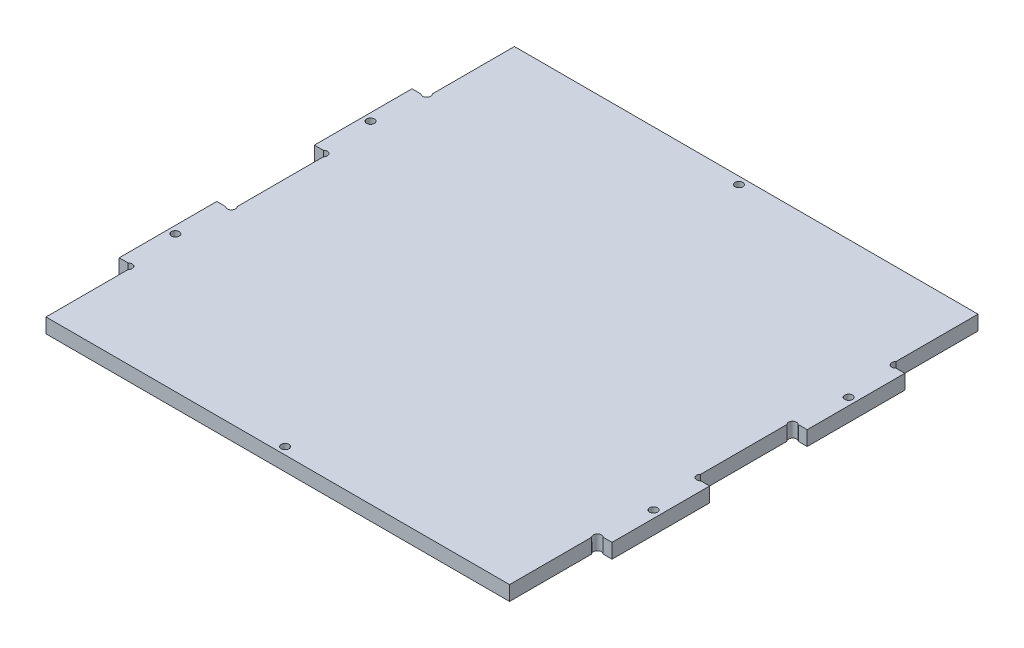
ISO-10303-21;
HEADER;
FILE_DESCRIPTION(('STEP AP214'),'2;1');
FILE_NAME('part.step','',(''),(''),'','','');
FILE_SCHEMA(('AUTOMOTIVE_DESIGN { 1 0 10303 214 1 1 1 1 }'));
ENDSEC;
DATA;
#1=APPLICATION_CONTEXT('core data for automotive mechanical design processes');
#2=APPLICATION_PROTOCOL_DEFINITION('international standard','automotive_design',2000,#1);
#3=PRODUCT_CONTEXT('',#1,'mechanical');
#4=PRODUCT('Part','Part','',(#3));
#5=PRODUCT_RELATED_PRODUCT_CATEGORY('part','',(#4));
#6=PRODUCT_DEFINITION_FORMATION('','',#4);
#7=PRODUCT_DEFINITION_CONTEXT('part definition',#1,'design');
#8=PRODUCT_DEFINITION('design','',#6,#7);
#9=PRODUCT_DEFINITION_SHAPE('','',#8);
#10=(LENGTH_UNIT() NAMED_UNIT(*) SI_UNIT(.MILLI.,.METRE.));
#11=(NAMED_UNIT(*) PLANE_ANGLE_UNIT() SI_UNIT($,.RADIAN.));
#12=(NAMED_UNIT(*) SI_UNIT($,.STERADIAN.) SOLID_ANGLE_UNIT());
#13=UNCERTAINTY_MEASURE_WITH_UNIT(LENGTH_MEASURE(1.E-05),#10,'distance_accuracy_value','');
#14=(GEOMETRIC_REPRESENTATION_CONTEXT(3) GLOBAL_UNCERTAINTY_ASSIGNED_CONTEXT((#13)) GLOBAL_UNIT_ASSIGNED_CONTEXT((#10,
#11,#12)) REPRESENTATION_CONTEXT('',''));
#15=CARTESIAN_POINT('',(0.,0.,0.));
#16=DIRECTION('',(0.,0.,1.));
#17=DIRECTION('',(1.,0.,0.));
#18=AXIS2_PLACEMENT_3D('',#15,#16,#17);
#19=CARTESIAN_POINT('',(96.1670078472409,6.,-18.8329921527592));
#20=DIRECTION('',(0.,1.,0.));
#21=DIRECTION('',(0.,0.,1.));
#22=AXIS2_PLACEMENT_3D('',#19,#20,#21);
#23=PLANE('',#22);
#24=CARTESIAN_POINT('',(0.,6.,-92.9999999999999));
#25=DIRECTION('',(0.,1.,0.));
#26=DIRECTION('',(0.,0.,1.));
#27=AXIS2_PLACEMENT_3D('',#24,#25,#26);
#28=CIRCLE('',#27,1.6);
#29=CARTESIAN_POINT('',(0.,6.,-91.3999999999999));
#30=VERTEX_POINT('',#29);
#31=EDGE_CURVE('E512',#30,#30,#28,.T.);
#32=ORIENTED_EDGE('',*,*,#31,.F.);
#33=EDGE_LOOP('',(#32));
#34=FACE_BOUND('',#33,.T.);
#35=CARTESIAN_POINT('',(-98.,6.,40.));
#36=DIRECTION('',(0.,1.,0.));
#37=DIRECTION('',(0.,0.,1.));
#38=AXIS2_PLACEMENT_3D('',#35,#36,#37);
#39=CIRCLE('',#38,1.60000000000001);
#40=CARTESIAN_POINT('',(-98.,6.,41.6));
#41=VERTEX_POINT('',#40);
#42=EDGE_CURVE('E524',#41,#41,#39,.T.);
#43=ORIENTED_EDGE('',*,*,#42,.F.);
#44=EDGE_LOOP('',(#43));
#45=FACE_BOUND('',#44,.T.);
#46=CARTESIAN_POINT('',(98.,6.,-40.));
#47=DIRECTION('',(0.,1.,0.));
#48=DIRECTION('',(0.,0.,1.));
#49=AXIS2_PLACEMENT_3D('',#46,#47,#48);
#50=CIRCLE('',#49,1.60000000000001);
#51=CARTESIAN_POINT('',(98.,6.,-38.4));
#52=VERTEX_POINT('',#51);
#53=EDGE_CURVE('E258',#52,#52,#50,.T.);
#54=ORIENTED_EDGE('',*,*,#53,.F.);
#55=EDGE_LOOP('',(#54));
#56=FACE_BOUND('',#55,.T.);
#57=CARTESIAN_POINT('',(96.1670078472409,6.,-18.8329921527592));
#58=DIRECTION('',(0.,-1.,0.));
#59=DIRECTION('',(0.,0.,1.));
#60=AXIS2_PLACEMENT_3D('',#57,#58,#59);
#61=CIRCLE('',#60,1.65039832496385);
#62=CARTESIAN_POINT('',(95.,6.,-17.6659843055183));
#63=VERTEX_POINT('',#62);
#64=CARTESIAN_POINT('',(97.3340156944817,6.,-20.));
#65=VERTEX_POINT('',#64);
#66=EDGE_CURVE('E309',#63,#65,#61,.T.);
#67=ORIENTED_EDGE('',*,*,#66,.T.);
#68=DIRECTION('',(1.,0.,0.));
#69=VECTOR('',#68,1.);
#70=CARTESIAN_POINT('',(97.3340156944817,6.,-20.));
#71=LINE('',#70,#69);
#72=CARTESIAN_POINT('',(101.,6.,-20.));
#73=VERTEX_POINT('',#72);
#74=EDGE_CURVE('E157',#65,#73,#71,.T.);
#75=ORIENTED_EDGE('',*,*,#74,.T.);
#76=DIRECTION('',(0.,0.,-1.));
#77=VECTOR('',#76,1.);
#78=CARTESIAN_POINT('',(101.,6.,-60.));
#79=LINE('',#78,#77);
#80=CARTESIAN_POINT('',(101.,6.,-60.));
#81=VERTEX_POINT('',#80);
#82=EDGE_CURVE('E384',#73,#81,#79,.T.);
#83=ORIENTED_EDGE('',*,*,#82,.T.);
#84=DIRECTION('',(-1.,0.,0.));
#85=VECTOR('',#84,1.);
#86=CARTESIAN_POINT('',(97.3340156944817,6.,-60.));
#87=LINE('',#86,#85);
#88=CARTESIAN_POINT('',(97.3340156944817,6.,-60.));
#89=VERTEX_POINT('',#88);
#90=EDGE_CURVE('E403',#81,#89,#87,.T.);
#91=ORIENTED_EDGE('',*,*,#90,.T.);
#92=CARTESIAN_POINT('',(96.1670078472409,6.,-61.1670078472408));
#93=DIRECTION('',(0.,-1.,0.));
#94=DIRECTION('',(0.,0.,-1.));
#95=AXIS2_PLACEMENT_3D('',#92,#93,#94);
#96=CIRCLE('',#95,1.65039832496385);
#97=CARTESIAN_POINT('',(95.,6.,-62.3340156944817));
#98=VERTEX_POINT('',#97);
#99=EDGE_CURVE('E400',#89,#98,#96,.T.);
#100=ORIENTED_EDGE('',*,*,#99,.T.);
#101=DIRECTION('',(0.,0.,-1.));
#102=VECTOR('',#101,1.);
#103=CARTESIAN_POINT('',(95.,6.,-62.3340156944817));
#104=LINE('',#103,#102);
#105=CARTESIAN_POINT('',(95.,6.,-96.));
#106=VERTEX_POINT('',#105);
#107=EDGE_CURVE('E402',#98,#106,#104,.T.);
#108=ORIENTED_EDGE('',*,*,#107,.T.);
#109=DIRECTION('',(-1.,0.,0.));
#110=VECTOR('',#109,1.);
#111=CARTESIAN_POINT('',(-95.0000000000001,6.,-96.));
#112=LINE('',#111,#110);
#113=CARTESIAN_POINT('',(-95.0000000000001,6.,-96.));
#114=VERTEX_POINT('',#113);
#115=EDGE_CURVE('E405',#106,#114,#112,.T.);
#116=ORIENTED_EDGE('',*,*,#115,.T.);
#117=DIRECTION('',(0.,0.,1.));
#118=VECTOR('',#117,1.);
#119=CARTESIAN_POINT('',(-95.,6.,-62.3340156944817));
#120=LINE('',#119,#118);
#121=CARTESIAN_POINT('',(-95.,6.,-62.3340156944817));
#122=VERTEX_POINT('',#121);
#123=EDGE_CURVE('E411',#114,#122,#120,.T.);
#124=ORIENTED_EDGE('',*,*,#123,.T.);
#125=CARTESIAN_POINT('',(-96.1670078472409,6.,-61.1670078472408));
#126=DIRECTION('',(0.,-1.,0.));
#127=DIRECTION('',(0.,0.,1.));
#128=AXIS2_PLACEMENT_3D('',#125,#126,#127);
#129=CIRCLE('',#128,1.65039832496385);
#130=CARTESIAN_POINT('',(-97.3340156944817,6.,-60.));
#131=VERTEX_POINT('',#130);
#132=EDGE_CURVE('E413',#122,#131,#129,.T.);
#133=ORIENTED_EDGE('',*,*,#132,.T.);
#134=DIRECTION('',(-1.,0.,0.));
#135=VECTOR('',#134,1.);
#136=CARTESIAN_POINT('',(-97.3340156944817,6.,-60.));
#137=LINE('',#136,#135);
#138=CARTESIAN_POINT('',(-101.,6.,-60.));
#139=VERTEX_POINT('',#138);
#140=EDGE_CURVE('E415',#131,#139,#137,.T.);
#141=ORIENTED_EDGE('',*,*,#140,.T.);
#142=DIRECTION('',(0.,0.,1.));
#143=VECTOR('',#142,1.);
#144=CARTESIAN_POINT('',(-101.,6.,-60.));
#145=LINE('',#144,#143);
#146=CARTESIAN_POINT('',(-101.,6.,-20.));
#147=VERTEX_POINT('',#146);
#148=EDGE_CURVE('E417',#139,#147,#145,.T.);
#149=ORIENTED_EDGE('',*,*,#148,.T.);
#150=DIRECTION('',(1.,0.,0.));
#151=VECTOR('',#150,1.);
#152=CARTESIAN_POINT('',(-97.3340156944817,6.,-19.9999999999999));
#153=LINE('',#152,#151);
#154=CARTESIAN_POINT('',(-97.3340156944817,6.,-19.9999999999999));
#155=VERTEX_POINT('',#154);
#156=EDGE_CURVE('E419',#147,#155,#153,.T.);
#157=ORIENTED_EDGE('',*,*,#156,.T.);
#158=CARTESIAN_POINT('',(-96.1670078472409,6.,-18.8329921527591));
#159=DIRECTION('',(0.,-1.,0.));
#160=DIRECTION('',(0.,0.,-1.));
#161=AXIS2_PLACEMENT_3D('',#158,#159,#160);
#162=CIRCLE('',#161,1.65039832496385);
#163=CARTESIAN_POINT('',(-95.,6.,-17.6659843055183));
#164=VERTEX_POINT('',#163);
#165=EDGE_CURVE('E421',#155,#164,#162,.T.);
#166=ORIENTED_EDGE('',*,*,#165,.T.);
#167=DIRECTION('',(0.,0.,1.));
#168=VECTOR('',#167,1.);
#169=CARTESIAN_POINT('',(-95.,6.,-17.6659843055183));
#170=LINE('',#169,#168);
#171=CARTESIAN_POINT('',(-95.,6.,17.6659843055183));
#172=VERTEX_POINT('',#171);
#173=EDGE_CURVE('E423',#164,#172,#170,.T.);
#174=ORIENTED_EDGE('',*,*,#173,.T.);
#175=CARTESIAN_POINT('',(-96.1670078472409,6.,18.8329921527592));
#176=DIRECTION('',(0.,-1.,0.));
#177=DIRECTION('',(0.,0.,1.));
#178=AXIS2_PLACEMENT_3D('',#175,#176,#177);
#179=CIRCLE('',#178,1.65039832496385);
#180=CARTESIAN_POINT('',(-97.3340156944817,6.,20.));
#181=VERTEX_POINT('',#180);
#182=EDGE_CURVE('E425',#172,#181,#179,.T.);
#183=ORIENTED_EDGE('',*,*,#182,.T.);
#184=DIRECTION('',(-1.,0.,0.));
#185=VECTOR('',#184,1.);
#186=CARTESIAN_POINT('',(-97.3340156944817,6.,20.));
#187=LINE('',#186,#185);
#188=CARTESIAN_POINT('',(-101.,6.,20.));
#189=VERTEX_POINT('',#188);
#190=EDGE_CURVE('E427',#181,#189,#187,.T.);
#191=ORIENTED_EDGE('',*,*,#190,.T.);
#192=DIRECTION('',(0.,0.,1.));
#193=VECTOR('',#192,1.);
#194=CARTESIAN_POINT('',(-101.,6.,60.));
#195=LINE('',#194,#193);
#196=CARTESIAN_POINT('',(-101.,6.,60.));
#197=VERTEX_POINT('',#196);
#198=EDGE_CURVE('E429',#189,#197,#195,.T.);
#199=ORIENTED_EDGE('',*,*,#198,.T.);
#200=DIRECTION('',(1.,0.,0.));
#201=VECTOR('',#200,1.);
#202=CARTESIAN_POINT('',(-97.3340156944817,6.,60.0000000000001));
#203=LINE('',#202,#201);
#204=CARTESIAN_POINT('',(-97.3340156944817,6.,60.0000000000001));
#205=VERTEX_POINT('',#204);
#206=EDGE_CURVE('E431',#197,#205,#203,.T.);
#207=ORIENTED_EDGE('',*,*,#206,.T.);
#208=CARTESIAN_POINT('',(-96.1670078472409,6.,61.1670078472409));
#209=DIRECTION('',(0.,-1.,0.));
#210=DIRECTION('',(0.,0.,-1.));
#211=AXIS2_PLACEMENT_3D('',#208,#209,#210);
#212=CIRCLE('',#211,1.65039832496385);
#213=CARTESIAN_POINT('',(-95.,6.,62.3340156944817));
#214=VERTEX_POINT('',#213);
#215=EDGE_CURVE('E433',#205,#214,#212,.T.);
#216=ORIENTED_EDGE('',*,*,#215,.T.);
#217=DIRECTION('',(0.,0.,1.));
#218=VECTOR('',#217,1.);
#219=CARTESIAN_POINT('',(-95.,6.,62.3340156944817));
#220=LINE('',#219,#218);
#221=CARTESIAN_POINT('',(-95.,6.,96.));
#222=VERTEX_POINT('',#221);
#223=EDGE_CURVE('E435',#214,#222,#220,.T.);
#224=ORIENTED_EDGE('',*,*,#223,.T.);
#225=DIRECTION('',(1.,0.,0.));
#226=VECTOR('',#225,1.);
#227=CARTESIAN_POINT('',(-95.,6.,96.));
#228=LINE('',#227,#226);
#229=CARTESIAN_POINT('',(95.,6.,96.));
#230=VERTEX_POINT('',#229);
#231=EDGE_CURVE('E437',#222,#230,#228,.T.);
#232=ORIENTED_EDGE('',*,*,#231,.T.);
#233=DIRECTION('',(0.,0.,-1.));
#234=VECTOR('',#233,1.);
#235=CARTESIAN_POINT('',(95.,6.,62.3340156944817));
#236=LINE('',#235,#234);
#237=CARTESIAN_POINT('',(95.,6.,62.3340156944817));
#238=VERTEX_POINT('',#237);
#239=EDGE_CURVE('E439',#230,#238,#236,.T.);
#240=ORIENTED_EDGE('',*,*,#239,.T.);
#241=CARTESIAN_POINT('',(96.1670078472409,6.,61.1670078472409));
#242=DIRECTION('',(0.,-1.,0.));
#243=DIRECTION('',(0.,0.,1.));
#244=AXIS2_PLACEMENT_3D('',#241,#242,#243);
#245=CIRCLE('',#244,1.65039832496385);
#246=CARTESIAN_POINT('',(97.3340156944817,6.,60.));
#247=VERTEX_POINT('',#246);
#248=EDGE_CURVE('E441',#238,#247,#245,.T.);
#249=ORIENTED_EDGE('',*,*,#248,.T.);
#250=DIRECTION('',(1.,0.,0.));
#251=VECTOR('',#250,1.);
#252=CARTESIAN_POINT('',(97.3340156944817,6.,60.));
#253=LINE('',#252,#251);
#254=CARTESIAN_POINT('',(101.,6.,60.));
#255=VERTEX_POINT('',#254);
#256=EDGE_CURVE('E443',#247,#255,#253,.T.);
#257=ORIENTED_EDGE('',*,*,#256,.T.);
#258=DIRECTION('',(0.,0.,-1.));
#259=VECTOR('',#258,1.);
#260=CARTESIAN_POINT('',(101.,6.,60.));
#261=LINE('',#260,#259);
#262=CARTESIAN_POINT('',(101.,6.,20.));
#263=VERTEX_POINT('',#262);
#264=EDGE_CURVE('E236',#255,#263,#261,.T.);
#265=ORIENTED_EDGE('',*,*,#264,.T.);
#266=DIRECTION('',(-1.,0.,0.));
#267=VECTOR('',#266,1.);
#268=CARTESIAN_POINT('',(97.3340156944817,6.,20.));
#269=LINE('',#268,#267);
#270=CARTESIAN_POINT('',(97.3340156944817,6.,20.));
#271=VERTEX_POINT('',#270);
#272=EDGE_CURVE('E230',#263,#271,#269,.T.);
#273=ORIENTED_EDGE('',*,*,#272,.T.);
#274=CARTESIAN_POINT('',(96.1670078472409,6.,18.8329921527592));
#275=DIRECTION('',(0.,-1.,0.));
#276=DIRECTION('',(0.,0.,-1.));
#277=AXIS2_PLACEMENT_3D('',#274,#275,#276);
#278=CIRCLE('',#277,1.65039832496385);
#279=CARTESIAN_POINT('',(95.,6.,17.6659843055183));
#280=VERTEX_POINT('',#279);
#281=EDGE_CURVE('E234',#271,#280,#278,.T.);
#282=ORIENTED_EDGE('',*,*,#281,.T.);
#283=DIRECTION('',(0.,0.,-1.));
#284=VECTOR('',#283,1.);
#285=CARTESIAN_POINT('',(95.,6.,-17.6659843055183));
#286=LINE('',#285,#284);
#287=EDGE_CURVE('E54',#280,#63,#286,.T.);
#288=ORIENTED_EDGE('',*,*,#287,.T.);
#289=EDGE_LOOP('',(#67,#75,#83,#91,#100,#108,#116,#124,#133,#141,#149,#157,#166,#174,#183,#191,
#199,#207,#216,#224,#232,#240,#249,#257,#265,#273,#282,#288));
#290=FACE_BOUND('',#289,.T.);
#291=CARTESIAN_POINT('',(98.,6.,40.));
#292=DIRECTION('',(0.,1.,0.));
#293=DIRECTION('',(0.,0.,-1.));
#294=AXIS2_PLACEMENT_3D('',#291,#292,#293);
#295=CIRCLE('',#294,1.60000000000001);
#296=CARTESIAN_POINT('',(98.,6.,38.4));
#297=VERTEX_POINT('',#296);
#298=EDGE_CURVE('E530',#297,#297,#295,.T.);
#299=ORIENTED_EDGE('',*,*,#298,.F.);
#300=EDGE_LOOP('',(#299));
#301=FACE_BOUND('',#300,.T.);
#302=CARTESIAN_POINT('',(-98.,6.,-40.));
#303=DIRECTION('',(0.,1.,0.));
#304=DIRECTION('',(0.,0.,-1.));
#305=AXIS2_PLACEMENT_3D('',#302,#303,#304);
#306=CIRCLE('',#305,1.60000000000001);
#307=CARTESIAN_POINT('',(-98.,6.,-41.6));
#308=VERTEX_POINT('',#307);
#309=EDGE_CURVE('E518',#308,#308,#306,.T.);
#310=ORIENTED_EDGE('',*,*,#309,.F.);
#311=EDGE_LOOP('',(#310));
#312=FACE_BOUND('',#311,.T.);
#313=CARTESIAN_POINT('',(0.,6.,92.9999999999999));
#314=DIRECTION('',(0.,1.,0.));
#315=DIRECTION('',(0.,0.,-1.));
#316=AXIS2_PLACEMENT_3D('',#313,#314,#315);
#317=CIRCLE('',#316,1.6);
#318=CARTESIAN_POINT('',(0.,6.,91.3999999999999));
#319=VERTEX_POINT('',#318);
#320=EDGE_CURVE('E503',#319,#319,#317,.T.);
#321=ORIENTED_EDGE('',*,*,#320,.F.);
#322=EDGE_LOOP('',(#321));
#323=FACE_BOUND('',#322,.T.);
#324=ADVANCED_FACE('F37',(#34,#45,#56,#290,#301,#312,#323),#23,.T.);
#325=CARTESIAN_POINT('',(96.1670078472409,0.,-18.8329921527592));
#326=DIRECTION('',(0.,1.,0.));
#327=DIRECTION('',(0.,0.,1.));
#328=AXIS2_PLACEMENT_3D('',#325,#326,#327);
#329=PLANE('',#328);
#330=CARTESIAN_POINT('',(0.,0.,-92.9999999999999));
#331=DIRECTION('',(0.,1.,0.));
#332=DIRECTION('',(0.,0.,1.));
#333=AXIS2_PLACEMENT_3D('',#330,#331,#332);
#334=CIRCLE('',#333,1.6);
#335=CARTESIAN_POINT('',(0.,0.,-91.3999999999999));
#336=VERTEX_POINT('',#335);
#337=EDGE_CURVE('E509',#336,#336,#334,.T.);
#338=ORIENTED_EDGE('',*,*,#337,.T.);
#339=EDGE_LOOP('',(#338));
#340=FACE_BOUND('',#339,.T.);
#341=CARTESIAN_POINT('',(-98.,0.,40.));
#342=DIRECTION('',(0.,1.,0.));
#343=DIRECTION('',(0.,0.,1.));
#344=AXIS2_PLACEMENT_3D('',#341,#342,#343);
#345=CIRCLE('',#344,1.60000000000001);
#346=CARTESIAN_POINT('',(-98.,0.,41.6));
#347=VERTEX_POINT('',#346);
#348=EDGE_CURVE('E521',#347,#347,#345,.T.);
#349=ORIENTED_EDGE('',*,*,#348,.T.);
#350=EDGE_LOOP('',(#349));
#351=FACE_BOUND('',#350,.T.);
#352=CARTESIAN_POINT('',(98.,0.,-40.));
#353=DIRECTION('',(0.,1.,0.));
#354=DIRECTION('',(0.,0.,1.));
#355=AXIS2_PLACEMENT_3D('',#352,#353,#354);
#356=CIRCLE('',#355,1.60000000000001);
#357=CARTESIAN_POINT('',(98.,0.,-38.4));
#358=VERTEX_POINT('',#357);
#359=EDGE_CURVE('E533',#358,#358,#356,.T.);
#360=ORIENTED_EDGE('',*,*,#359,.T.);
#361=EDGE_LOOP('',(#360));
#362=FACE_BOUND('',#361,.T.);
#363=CARTESIAN_POINT('',(96.1670078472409,0.,-18.8329921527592));
#364=DIRECTION('',(0.,-1.,0.));
#365=DIRECTION('',(0.,0.,1.));
#366=AXIS2_PLACEMENT_3D('',#363,#364,#365);
#367=CIRCLE('',#366,1.65039832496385);
#368=CARTESIAN_POINT('',(95.,0.,-17.6659843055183));
#369=VERTEX_POINT('',#368);
#370=CARTESIAN_POINT('',(97.3340156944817,0.,-20.));
#371=VERTEX_POINT('',#370);
#372=EDGE_CURVE('E254',#369,#371,#367,.T.);
#373=ORIENTED_EDGE('',*,*,#372,.F.);
#374=DIRECTION('',(0.,0.,-1.));
#375=VECTOR('',#374,1.);
#376=CARTESIAN_POINT('',(95.,0.,-17.6659843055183));
#377=LINE('',#376,#375);
#378=CARTESIAN_POINT('',(95.,0.,17.6659843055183));
#379=VERTEX_POINT('',#378);
#380=EDGE_CURVE('E149',#379,#369,#377,.T.);
#381=ORIENTED_EDGE('',*,*,#380,.F.);
#382=CARTESIAN_POINT('',(96.1670078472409,0.,18.8329921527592));
#383=DIRECTION('',(0.,-1.,0.));
#384=DIRECTION('',(0.,0.,-1.));
#385=AXIS2_PLACEMENT_3D('',#382,#383,#384);
#386=CIRCLE('',#385,1.65039832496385);
#387=CARTESIAN_POINT('',(97.3340156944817,0.,20.));
#388=VERTEX_POINT('',#387);
#389=EDGE_CURVE('E143',#388,#379,#386,.T.);
#390=ORIENTED_EDGE('',*,*,#389,.F.);
#391=DIRECTION('',(-1.,0.,0.));
#392=VECTOR('',#391,1.);
#393=CARTESIAN_POINT('',(97.3340156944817,0.,20.));
#394=LINE('',#393,#392);
#395=CARTESIAN_POINT('',(101.,0.,20.));
#396=VERTEX_POINT('',#395);
#397=EDGE_CURVE('E244',#396,#388,#394,.T.);
#398=ORIENTED_EDGE('',*,*,#397,.F.);
#399=DIRECTION('',(0.,0.,-1.));
#400=VECTOR('',#399,1.);
#401=CARTESIAN_POINT('',(101.,0.,60.));
#402=LINE('',#401,#400);
#403=CARTESIAN_POINT('',(101.,0.,60.));
#404=VERTEX_POINT('',#403);
#405=EDGE_CURVE('E304',#404,#396,#402,.T.);
#406=ORIENTED_EDGE('',*,*,#405,.F.);
#407=DIRECTION('',(1.,0.,0.));
#408=VECTOR('',#407,1.);
#409=CARTESIAN_POINT('',(97.3340156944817,0.,60.));
#410=LINE('',#409,#408);
#411=CARTESIAN_POINT('',(97.3340156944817,0.,60.));
#412=VERTEX_POINT('',#411);
#413=EDGE_CURVE('E302',#412,#404,#410,.T.);
#414=ORIENTED_EDGE('',*,*,#413,.F.);
#415=CARTESIAN_POINT('',(96.1670078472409,0.,61.1670078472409));
#416=DIRECTION('',(0.,-1.,0.));
#417=DIRECTION('',(0.,0.,1.));
#418=AXIS2_PLACEMENT_3D('',#415,#416,#417);
#419=CIRCLE('',#418,1.65039832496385);
#420=CARTESIAN_POINT('',(95.,0.,62.3340156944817));
#421=VERTEX_POINT('',#420);
#422=EDGE_CURVE('E300',#421,#412,#419,.T.);
#423=ORIENTED_EDGE('',*,*,#422,.F.);
#424=DIRECTION('',(0.,0.,-1.));
#425=VECTOR('',#424,1.);
#426=CARTESIAN_POINT('',(95.,0.,62.3340156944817));
#427=LINE('',#426,#425);
#428=CARTESIAN_POINT('',(95.,0.,96.));
#429=VERTEX_POINT('',#428);
#430=EDGE_CURVE('E298',#429,#421,#427,.T.);
#431=ORIENTED_EDGE('',*,*,#430,.F.);
#432=DIRECTION('',(1.,0.,0.));
#433=VECTOR('',#432,1.);
#434=CARTESIAN_POINT('',(-95.,0.,96.));
#435=LINE('',#434,#433);
#436=CARTESIAN_POINT('',(-95.,0.,96.));
#437=VERTEX_POINT('',#436);
#438=EDGE_CURVE('E296',#437,#429,#435,.T.);
#439=ORIENTED_EDGE('',*,*,#438,.F.);
#440=DIRECTION('',(0.,0.,1.));
#441=VECTOR('',#440,1.);
#442=CARTESIAN_POINT('',(-95.,0.,62.3340156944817));
#443=LINE('',#442,#441);
#444=CARTESIAN_POINT('',(-95.,0.,62.3340156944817));
#445=VERTEX_POINT('',#444);
#446=EDGE_CURVE('E294',#445,#437,#443,.T.);
#447=ORIENTED_EDGE('',*,*,#446,.F.);
#448=CARTESIAN_POINT('',(-96.1670078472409,0.,61.1670078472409));
#449=DIRECTION('',(0.,-1.,0.));
#450=DIRECTION('',(0.,0.,-1.));
#451=AXIS2_PLACEMENT_3D('',#448,#449,#450);
#452=CIRCLE('',#451,1.65039832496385);
#453=CARTESIAN_POINT('',(-97.3340156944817,0.,60.0000000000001));
#454=VERTEX_POINT('',#453);
#455=EDGE_CURVE('E292',#454,#445,#452,.T.);
#456=ORIENTED_EDGE('',*,*,#455,.F.);
#457=DIRECTION('',(1.,0.,0.));
#458=VECTOR('',#457,1.);
#459=CARTESIAN_POINT('',(-97.3340156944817,0.,60.0000000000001));
#460=LINE('',#459,#458);
#461=CARTESIAN_POINT('',(-101.,0.,60.));
#462=VERTEX_POINT('',#461);
#463=EDGE_CURVE('E290',#462,#454,#460,.T.);
#464=ORIENTED_EDGE('',*,*,#463,.F.);
#465=DIRECTION('',(0.,0.,1.));
#466=VECTOR('',#465,1.);
#467=CARTESIAN_POINT('',(-101.,0.,60.));
#468=LINE('',#467,#466);
#469=CARTESIAN_POINT('',(-101.,0.,20.));
#470=VERTEX_POINT('',#469);
#471=EDGE_CURVE('E288',#470,#462,#468,.T.);
#472=ORIENTED_EDGE('',*,*,#471,.F.);
#473=DIRECTION('',(-1.,0.,0.));
#474=VECTOR('',#473,1.);
#475=CARTESIAN_POINT('',(-97.3340156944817,0.,20.));
#476=LINE('',#475,#474);
#477=CARTESIAN_POINT('',(-97.3340156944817,0.,20.));
#478=VERTEX_POINT('',#477);
#479=EDGE_CURVE('E286',#478,#470,#476,.T.);
#480=ORIENTED_EDGE('',*,*,#479,.F.);
#481=CARTESIAN_POINT('',(-96.1670078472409,0.,18.8329921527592));
#482=DIRECTION('',(0.,-1.,0.));
#483=DIRECTION('',(0.,0.,1.));
#484=AXIS2_PLACEMENT_3D('',#481,#482,#483);
#485=CIRCLE('',#484,1.65039832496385);
#486=CARTESIAN_POINT('',(-95.,0.,17.6659843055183));
#487=VERTEX_POINT('',#486);
#488=EDGE_CURVE('E284',#487,#478,#485,.T.);
#489=ORIENTED_EDGE('',*,*,#488,.F.);
#490=DIRECTION('',(0.,0.,1.));
#491=VECTOR('',#490,1.);
#492=CARTESIAN_POINT('',(-95.,0.,-17.6659843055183));
#493=LINE('',#492,#491);
#494=CARTESIAN_POINT('',(-95.,0.,-17.6659843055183));
#495=VERTEX_POINT('',#494);
#496=EDGE_CURVE('E282',#495,#487,#493,.T.);
#497=ORIENTED_EDGE('',*,*,#496,.F.);
#498=CARTESIAN_POINT('',(-96.1670078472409,0.,-18.8329921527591));
#499=DIRECTION('',(0.,-1.,0.));
#500=DIRECTION('',(0.,0.,-1.));
#501=AXIS2_PLACEMENT_3D('',#498,#499,#500);
#502=CIRCLE('',#501,1.65039832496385);
#503=CARTESIAN_POINT('',(-97.3340156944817,0.,-19.9999999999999));
#504=VERTEX_POINT('',#503);
#505=EDGE_CURVE('E280',#504,#495,#502,.T.);
#506=ORIENTED_EDGE('',*,*,#505,.F.);
#507=DIRECTION('',(1.,0.,0.));
#508=VECTOR('',#507,1.);
#509=CARTESIAN_POINT('',(-97.3340156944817,0.,-19.9999999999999));
#510=LINE('',#509,#508);
#511=CARTESIAN_POINT('',(-101.,0.,-20.));
#512=VERTEX_POINT('',#511);
#513=EDGE_CURVE('E278',#512,#504,#510,.T.);
#514=ORIENTED_EDGE('',*,*,#513,.F.);
#515=DIRECTION('',(0.,0.,1.));
#516=VECTOR('',#515,1.);
#517=CARTESIAN_POINT('',(-101.,0.,-60.));
#518=LINE('',#517,#516);
#519=CARTESIAN_POINT('',(-101.,0.,-60.));
#520=VERTEX_POINT('',#519);
#521=EDGE_CURVE('E276',#520,#512,#518,.T.);
#522=ORIENTED_EDGE('',*,*,#521,.F.);
#523=DIRECTION('',(-1.,0.,0.));
#524=VECTOR('',#523,1.);
#525=CARTESIAN_POINT('',(-97.3340156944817,0.,-60.));
#526=LINE('',#525,#524);
#527=CARTESIAN_POINT('',(-97.3340156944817,0.,-60.));
#528=VERTEX_POINT('',#527);
#529=EDGE_CURVE('E274',#528,#520,#526,.T.);
#530=ORIENTED_EDGE('',*,*,#529,.F.);
#531=CARTESIAN_POINT('',(-96.1670078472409,0.,-61.1670078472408));
#532=DIRECTION('',(0.,-1.,0.));
#533=DIRECTION('',(0.,0.,1.));
#534=AXIS2_PLACEMENT_3D('',#531,#532,#533);
#535=CIRCLE('',#534,1.65039832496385);
#536=CARTESIAN_POINT('',(-95.,0.,-62.3340156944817));
#537=VERTEX_POINT('',#536);
#538=EDGE_CURVE('E272',#537,#528,#535,.T.);
#539=ORIENTED_EDGE('',*,*,#538,.F.);
#540=DIRECTION('',(0.,0.,1.));
#541=VECTOR('',#540,1.);
#542=CARTESIAN_POINT('',(-95.,0.,-62.3340156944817));
#543=LINE('',#542,#541);
#544=CARTESIAN_POINT('',(-95.0000000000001,0.,-96.));
#545=VERTEX_POINT('',#544);
#546=EDGE_CURVE('E270',#545,#537,#543,.T.);
#547=ORIENTED_EDGE('',*,*,#546,.F.);
#548=DIRECTION('',(-1.,0.,0.));
#549=VECTOR('',#548,1.);
#550=CARTESIAN_POINT('',(-95.0000000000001,0.,-96.));
#551=LINE('',#550,#549);
#552=CARTESIAN_POINT('',(95.,0.,-96.));
#553=VERTEX_POINT('',#552);
#554=EDGE_CURVE('E268',#553,#545,#551,.T.);
#555=ORIENTED_EDGE('',*,*,#554,.F.);
#556=DIRECTION('',(0.,0.,-1.));
#557=VECTOR('',#556,1.);
#558=CARTESIAN_POINT('',(95.,0.,-62.3340156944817));
#559=LINE('',#558,#557);
#560=CARTESIAN_POINT('',(95.,0.,-62.3340156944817));
#561=VERTEX_POINT('',#560);
#562=EDGE_CURVE('E266',#561,#553,#559,.T.);
#563=ORIENTED_EDGE('',*,*,#562,.F.);
#564=CARTESIAN_POINT('',(96.1670078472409,0.,-61.1670078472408));
#565=DIRECTION('',(0.,-1.,0.));
#566=DIRECTION('',(0.,0.,-1.));
#567=AXIS2_PLACEMENT_3D('',#564,#565,#566);
#568=CIRCLE('',#567,1.65039832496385);
#569=CARTESIAN_POINT('',(97.3340156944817,0.,-60.));
#570=VERTEX_POINT('',#569);
#571=EDGE_CURVE('E264',#570,#561,#568,.T.);
#572=ORIENTED_EDGE('',*,*,#571,.F.);
#573=DIRECTION('',(-1.,0.,0.));
#574=VECTOR('',#573,1.);
#575=CARTESIAN_POINT('',(97.3340156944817,0.,-60.));
#576=LINE('',#575,#574);
#577=CARTESIAN_POINT('',(101.,0.,-60.));
#578=VERTEX_POINT('',#577);
#579=EDGE_CURVE('E262',#578,#570,#576,.T.);
#580=ORIENTED_EDGE('',*,*,#579,.F.);
#581=DIRECTION('',(0.,0.,-1.));
#582=VECTOR('',#581,1.);
#583=CARTESIAN_POINT('',(101.,0.,-60.));
#584=LINE('',#583,#582);
#585=CARTESIAN_POINT('',(101.,0.,-20.));
#586=VERTEX_POINT('',#585);
#587=EDGE_CURVE('E260',#586,#578,#584,.T.);
#588=ORIENTED_EDGE('',*,*,#587,.F.);
#589=DIRECTION('',(1.,0.,0.));
#590=VECTOR('',#589,1.);
#591=CARTESIAN_POINT('',(97.3340156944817,0.,-20.));
#592=LINE('',#591,#590);
#593=EDGE_CURVE('E257',#371,#586,#592,.T.);
#594=ORIENTED_EDGE('',*,*,#593,.F.);
#595=EDGE_LOOP('',(#373,#381,#390,#398,#406,#414,#423,#431,#439,#447,#456,#464,#472,#480,#489,
#497,#506,#514,#522,#530,#539,#547,#555,#563,#572,#580,#588,#594));
#596=FACE_BOUND('',#595,.T.);
#597=CARTESIAN_POINT('',(98.,0.,40.));
#598=DIRECTION('',(0.,1.,0.));
#599=DIRECTION('',(0.,0.,-1.));
#600=AXIS2_PLACEMENT_3D('',#597,#598,#599);
#601=CIRCLE('',#600,1.60000000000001);
#602=CARTESIAN_POINT('',(98.,0.,38.4));
#603=VERTEX_POINT('',#602);
#604=EDGE_CURVE('E527',#603,#603,#601,.T.);
#605=ORIENTED_EDGE('',*,*,#604,.T.);
#606=EDGE_LOOP('',(#605));
#607=FACE_BOUND('',#606,.T.);
#608=CARTESIAN_POINT('',(-98.,0.,-40.));
#609=DIRECTION('',(0.,1.,0.));
#610=DIRECTION('',(0.,0.,-1.));
#611=AXIS2_PLACEMENT_3D('',#608,#609,#610);
#612=CIRCLE('',#611,1.60000000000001);
#613=CARTESIAN_POINT('',(-98.,0.,-41.6));
#614=VERTEX_POINT('',#613);
#615=EDGE_CURVE('E515',#614,#614,#612,.T.);
#616=ORIENTED_EDGE('',*,*,#615,.T.);
#617=EDGE_LOOP('',(#616));
#618=FACE_BOUND('',#617,.T.);
#619=CARTESIAN_POINT('',(0.,0.,92.9999999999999));
#620=DIRECTION('',(0.,1.,0.));
#621=DIRECTION('',(0.,0.,-1.));
#622=AXIS2_PLACEMENT_3D('',#619,#620,#621);
#623=CIRCLE('',#622,1.6);
#624=CARTESIAN_POINT('',(0.,0.,91.3999999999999));
#625=VERTEX_POINT('',#624);
#626=EDGE_CURVE('E506',#625,#625,#623,.T.);
#627=ORIENTED_EDGE('',*,*,#626,.T.);
#628=EDGE_LOOP('',(#627));
#629=FACE_BOUND('',#628,.T.);
#630=ADVANCED_FACE('F388',(#340,#351,#362,#596,#607,#618,#629),#329,.F.);
#631=CARTESIAN_POINT('',(96.1670078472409,6.,-18.8329921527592));
#632=DIRECTION('',(0.,-1.,0.));
#633=DIRECTION('',(0.,0.,-1.));
#634=AXIS2_PLACEMENT_3D('',#631,#632,#633);
#635=CYLINDRICAL_SURFACE('',#634,1.65039832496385);
#636=ORIENTED_EDGE('',*,*,#372,.T.);
#637=DIRECTION('',(0.,-1.,0.));
#638=VECTOR('',#637,1.);
#639=CARTESIAN_POINT('',(97.3340156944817,6.,-20.));
#640=LINE('',#639,#638);
#641=EDGE_CURVE('E11',#65,#371,#640,.T.);
#642=ORIENTED_EDGE('',*,*,#641,.F.);
#643=ORIENTED_EDGE('',*,*,#66,.F.);
#644=DIRECTION('',(0.,-1.,0.));
#645=VECTOR('',#644,1.);
#646=CARTESIAN_POINT('',(95.,6.,-17.6659843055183));
#647=LINE('',#646,#645);
#648=EDGE_CURVE('E250',#63,#369,#647,.T.);
#649=ORIENTED_EDGE('',*,*,#648,.T.);
#650=EDGE_LOOP('',(#636,#642,#643,#649));
#651=FACE_BOUND('',#650,.T.);
#652=ADVANCED_FACE('F39',(#651),#635,.F.);
#653=CARTESIAN_POINT('',(97.3340156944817,6.,-20.));
#654=DIRECTION('',(0.,0.,-1.));
#655=DIRECTION('',(-1.,0.,0.));
#656=AXIS2_PLACEMENT_3D('',#653,#654,#655);
#657=PLANE('',#656);
#658=ORIENTED_EDGE('',*,*,#593,.T.);
#659=DIRECTION('',(0.,-1.,0.));
#660=VECTOR('',#659,1.);
#661=CARTESIAN_POINT('',(101.,6.,-20.));
#662=LINE('',#661,#660);
#663=EDGE_CURVE('E46',#73,#586,#662,.T.);
#664=ORIENTED_EDGE('',*,*,#663,.F.);
#665=ORIENTED_EDGE('',*,*,#74,.F.);
#666=ORIENTED_EDGE('',*,*,#641,.T.);
#667=EDGE_LOOP('',(#658,#664,#665,#666));
#668=FACE_BOUND('',#667,.T.);
#669=ADVANCED_FACE('F820',(#668),#657,.F.);
#670=CARTESIAN_POINT('',(101.,6.,-60.));
#671=DIRECTION('',(-1.,0.,0.));
#672=DIRECTION('',(0.,0.,1.));
#673=AXIS2_PLACEMENT_3D('',#670,#671,#672);
#674=PLANE('',#673);
#675=ORIENTED_EDGE('',*,*,#587,.T.);
#676=DIRECTION('',(0.,-1.,0.));
#677=VECTOR('',#676,1.);
#678=CARTESIAN_POINT('',(101.,6.,-60.));
#679=LINE('',#678,#677);
#680=EDGE_CURVE('E376',#81,#578,#679,.T.);
#681=ORIENTED_EDGE('',*,*,#680,.F.);
#682=ORIENTED_EDGE('',*,*,#82,.F.);
#683=ORIENTED_EDGE('',*,*,#663,.T.);
#684=EDGE_LOOP('',(#675,#681,#682,#683));
#685=FACE_BOUND('',#684,.T.);
#686=ADVANCED_FACE('F382',(#685),#674,.F.);
#687=CARTESIAN_POINT('',(97.3340156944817,6.,-60.));
#688=DIRECTION('',(0.,0.,1.));
#689=DIRECTION('',(1.,0.,0.));
#690=AXIS2_PLACEMENT_3D('',#687,#688,#689);
#691=PLANE('',#690);
#692=ORIENTED_EDGE('',*,*,#579,.T.);
#693=DIRECTION('',(0.,-1.,0.));
#694=VECTOR('',#693,1.);
#695=CARTESIAN_POINT('',(97.3340156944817,6.,-60.));
#696=LINE('',#695,#694);
#697=EDGE_CURVE('E373',#89,#570,#696,.T.);
#698=ORIENTED_EDGE('',*,*,#697,.F.);
#699=ORIENTED_EDGE('',*,*,#90,.F.);
#700=ORIENTED_EDGE('',*,*,#680,.T.);
#701=EDGE_LOOP('',(#692,#698,#699,#700));
#702=FACE_BOUND('',#701,.T.);
#703=ADVANCED_FACE('F394',(#702),#691,.F.);
#704=CARTESIAN_POINT('',(96.1670078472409,6.,-61.1670078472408));
#705=DIRECTION('',(0.,-1.,0.));
#706=DIRECTION('',(0.,0.,-1.));
#707=AXIS2_PLACEMENT_3D('',#704,#705,#706);
#708=CYLINDRICAL_SURFACE('',#707,1.65039832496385);
#709=ORIENTED_EDGE('',*,*,#571,.T.);
#710=DIRECTION('',(0.,-1.,0.));
#711=VECTOR('',#710,1.);
#712=CARTESIAN_POINT('',(95.,6.,-62.3340156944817));
#713=LINE('',#712,#711);
#714=EDGE_CURVE('E370',#98,#561,#713,.T.);
#715=ORIENTED_EDGE('',*,*,#714,.F.);
#716=ORIENTED_EDGE('',*,*,#99,.F.);
#717=ORIENTED_EDGE('',*,*,#697,.T.);
#718=EDGE_LOOP('',(#709,#715,#716,#717));
#719=FACE_BOUND('',#718,.T.);
#720=ADVANCED_FACE('F398',(#719),#708,.F.);
#721=CARTESIAN_POINT('',(95.,6.,-62.3340156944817));
#722=DIRECTION('',(-1.,0.,0.));
#723=DIRECTION('',(0.,0.,1.));
#724=AXIS2_PLACEMENT_3D('',#721,#722,#723);
#725=PLANE('',#724);
#726=ORIENTED_EDGE('',*,*,#562,.T.);
#727=DIRECTION('',(0.,-1.,0.));
#728=VECTOR('',#727,1.);
#729=CARTESIAN_POINT('',(95.,6.,-96.));
#730=LINE('',#729,#728);
#731=EDGE_CURVE('E367',#106,#553,#730,.T.);
#732=ORIENTED_EDGE('',*,*,#731,.F.);
#733=ORIENTED_EDGE('',*,*,#107,.F.);
#734=ORIENTED_EDGE('',*,*,#714,.T.);
#735=EDGE_LOOP('',(#726,#732,#733,#734));
#736=FACE_BOUND('',#735,.T.);
#737=ADVANCED_FACE('F785',(#736),#725,.F.);
#738=CARTESIAN_POINT('',(-95.0000000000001,6.,-96.));
#739=DIRECTION('',(0.,0.,1.));
#740=DIRECTION('',(1.,0.,0.));
#741=AXIS2_PLACEMENT_3D('',#738,#739,#740);
#742=PLANE('',#741);
#743=ORIENTED_EDGE('',*,*,#554,.T.);
#744=DIRECTION('',(0.,-1.,0.));
#745=VECTOR('',#744,1.);
#746=CARTESIAN_POINT('',(-95.0000000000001,6.,-96.));
#747=LINE('',#746,#745);
#748=EDGE_CURVE('E364',#114,#545,#747,.T.);
#749=ORIENTED_EDGE('',*,*,#748,.F.);
#750=ORIENTED_EDGE('',*,*,#115,.F.);
#751=ORIENTED_EDGE('',*,*,#731,.T.);
#752=EDGE_LOOP('',(#743,#749,#750,#751));
#753=FACE_BOUND('',#752,.T.);
#754=ADVANCED_FACE('F775',(#753),#742,.F.);
#755=CARTESIAN_POINT('',(-95.,6.,-62.3340156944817));
#756=DIRECTION('',(1.,0.,0.));
#757=DIRECTION('',(0.,0.,-1.));
#758=AXIS2_PLACEMENT_3D('',#755,#756,#757);
#759=PLANE('',#758);
#760=ORIENTED_EDGE('',*,*,#546,.T.);
#761=DIRECTION('',(0.,-1.,0.));
#762=VECTOR('',#761,1.);
#763=CARTESIAN_POINT('',(-95.,6.,-62.3340156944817));
#764=LINE('',#763,#762);
#765=EDGE_CURVE('E361',#122,#537,#764,.T.);
#766=ORIENTED_EDGE('',*,*,#765,.F.);
#767=ORIENTED_EDGE('',*,*,#123,.F.);
#768=ORIENTED_EDGE('',*,*,#748,.T.);
#769=EDGE_LOOP('',(#760,#766,#767,#768));
#770=FACE_BOUND('',#769,.T.);
#771=ADVANCED_FACE('F765',(#770),#759,.F.);
#772=CARTESIAN_POINT('',(-96.1670078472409,6.,-61.1670078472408));
#773=DIRECTION('',(0.,-1.,0.));
#774=DIRECTION('',(0.,0.,-1.));
#775=AXIS2_PLACEMENT_3D('',#772,#773,#774);
#776=CYLINDRICAL_SURFACE('',#775,1.65039832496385);
#777=ORIENTED_EDGE('',*,*,#538,.T.);
#778=DIRECTION('',(0.,-1.,0.));
#779=VECTOR('',#778,1.);
#780=CARTESIAN_POINT('',(-97.3340156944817,6.,-60.));
#781=LINE('',#780,#779);
#782=EDGE_CURVE('E358',#131,#528,#781,.T.);
#783=ORIENTED_EDGE('',*,*,#782,.F.);
#784=ORIENTED_EDGE('',*,*,#132,.F.);
#785=ORIENTED_EDGE('',*,*,#765,.T.);
#786=EDGE_LOOP('',(#777,#783,#784,#785));
#787=FACE_BOUND('',#786,.T.);
#788=ADVANCED_FACE('F755',(#787),#776,.F.);
#789=CARTESIAN_POINT('',(-97.3340156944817,6.,-60.));
#790=DIRECTION('',(0.,0.,1.));
#791=DIRECTION('',(1.,0.,0.));
#792=AXIS2_PLACEMENT_3D('',#789,#790,#791);
#793=PLANE('',#792);
#794=ORIENTED_EDGE('',*,*,#529,.T.);
#795=DIRECTION('',(0.,-1.,0.));
#796=VECTOR('',#795,1.);
#797=CARTESIAN_POINT('',(-101.,6.,-60.));
#798=LINE('',#797,#796);
#799=EDGE_CURVE('E355',#139,#520,#798,.T.);
#800=ORIENTED_EDGE('',*,*,#799,.F.);
#801=ORIENTED_EDGE('',*,*,#140,.F.);
#802=ORIENTED_EDGE('',*,*,#782,.T.);
#803=EDGE_LOOP('',(#794,#800,#801,#802));
#804=FACE_BOUND('',#803,.T.);
#805=ADVANCED_FACE('F745',(#804),#793,.F.);
#806=CARTESIAN_POINT('',(-101.,6.,-60.));
#807=DIRECTION('',(1.,0.,0.));
#808=DIRECTION('',(0.,0.,-1.));
#809=AXIS2_PLACEMENT_3D('',#806,#807,#808);
#810=PLANE('',#809);
#811=ORIENTED_EDGE('',*,*,#521,.T.);
#812=DIRECTION('',(0.,-1.,0.));
#813=VECTOR('',#812,1.);
#814=CARTESIAN_POINT('',(-101.,6.,-20.));
#815=LINE('',#814,#813);
#816=EDGE_CURVE('E352',#147,#512,#815,.T.);
#817=ORIENTED_EDGE('',*,*,#816,.F.);
#818=ORIENTED_EDGE('',*,*,#148,.F.);
#819=ORIENTED_EDGE('',*,*,#799,.T.);
#820=EDGE_LOOP('',(#811,#817,#818,#819));
#821=FACE_BOUND('',#820,.T.);
#822=ADVANCED_FACE('F735',(#821),#810,.F.);
#823=CARTESIAN_POINT('',(-97.3340156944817,6.,-19.9999999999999));
#824=DIRECTION('',(0.,0.,-1.));
#825=DIRECTION('',(-1.,0.,0.));
#826=AXIS2_PLACEMENT_3D('',#823,#824,#825);
#827=PLANE('',#826);
#828=ORIENTED_EDGE('',*,*,#513,.T.);
#829=DIRECTION('',(0.,-1.,0.));
#830=VECTOR('',#829,1.);
#831=CARTESIAN_POINT('',(-97.3340156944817,6.,-19.9999999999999));
#832=LINE('',#831,#830);
#833=EDGE_CURVE('E349',#155,#504,#832,.T.);
#834=ORIENTED_EDGE('',*,*,#833,.F.);
#835=ORIENTED_EDGE('',*,*,#156,.F.);
#836=ORIENTED_EDGE('',*,*,#816,.T.);
#837=EDGE_LOOP('',(#828,#834,#835,#836));
#838=FACE_BOUND('',#837,.T.);
#839=ADVANCED_FACE('F725',(#838),#827,.F.);
#840=CARTESIAN_POINT('',(-96.1670078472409,6.,-18.8329921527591));
#841=DIRECTION('',(0.,-1.,0.));
#842=DIRECTION('',(0.,0.,-1.));
#843=AXIS2_PLACEMENT_3D('',#840,#841,#842);
#844=CYLINDRICAL_SURFACE('',#843,1.65039832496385);
#845=ORIENTED_EDGE('',*,*,#505,.T.);
#846=DIRECTION('',(0.,-1.,0.));
#847=VECTOR('',#846,1.);
#848=CARTESIAN_POINT('',(-95.,6.,-17.6659843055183));
#849=LINE('',#848,#847);
#850=EDGE_CURVE('E346',#164,#495,#849,.T.);
#851=ORIENTED_EDGE('',*,*,#850,.F.);
#852=ORIENTED_EDGE('',*,*,#165,.F.);
#853=ORIENTED_EDGE('',*,*,#833,.T.);
#854=EDGE_LOOP('',(#845,#851,#852,#853));
#855=FACE_BOUND('',#854,.T.);
#856=ADVANCED_FACE('F715',(#855),#844,.F.);
#857=CARTESIAN_POINT('',(-95.,6.,-17.6659843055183));
#858=DIRECTION('',(1.,0.,0.));
#859=DIRECTION('',(0.,0.,-1.));
#860=AXIS2_PLACEMENT_3D('',#857,#858,#859);
#861=PLANE('',#860);
#862=ORIENTED_EDGE('',*,*,#496,.T.);
#863=DIRECTION('',(0.,-1.,0.));
#864=VECTOR('',#863,1.);
#865=CARTESIAN_POINT('',(-95.,6.,17.6659843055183));
#866=LINE('',#865,#864);
#867=EDGE_CURVE('E343',#172,#487,#866,.T.);
#868=ORIENTED_EDGE('',*,*,#867,.F.);
#869=ORIENTED_EDGE('',*,*,#173,.F.);
#870=ORIENTED_EDGE('',*,*,#850,.T.);
#871=EDGE_LOOP('',(#862,#868,#869,#870));
#872=FACE_BOUND('',#871,.T.);
#873=ADVANCED_FACE('F705',(#872),#861,.F.);
#874=CARTESIAN_POINT('',(-96.1670078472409,6.,18.8329921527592));
#875=DIRECTION('',(0.,-1.,0.));
#876=DIRECTION('',(0.,0.,-1.));
#877=AXIS2_PLACEMENT_3D('',#874,#875,#876);
#878=CYLINDRICAL_SURFACE('',#877,1.65039832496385);
#879=ORIENTED_EDGE('',*,*,#488,.T.);
#880=DIRECTION('',(0.,-1.,0.));
#881=VECTOR('',#880,1.);
#882=CARTESIAN_POINT('',(-97.3340156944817,6.,20.));
#883=LINE('',#882,#881);
#884=EDGE_CURVE('E340',#181,#478,#883,.T.);
#885=ORIENTED_EDGE('',*,*,#884,.F.);
#886=ORIENTED_EDGE('',*,*,#182,.F.);
#887=ORIENTED_EDGE('',*,*,#867,.T.);
#888=EDGE_LOOP('',(#879,#885,#886,#887));
#889=FACE_BOUND('',#888,.T.);
#890=ADVANCED_FACE('F695',(#889),#878,.F.);
#891=CARTESIAN_POINT('',(-97.3340156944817,6.,20.));
#892=DIRECTION('',(0.,0.,1.));
#893=DIRECTION('',(1.,0.,0.));
#894=AXIS2_PLACEMENT_3D('',#891,#892,#893);
#895=PLANE('',#894);
#896=ORIENTED_EDGE('',*,*,#479,.T.);
#897=DIRECTION('',(0.,-1.,0.));
#898=VECTOR('',#897,1.);
#899=CARTESIAN_POINT('',(-101.,6.,20.));
#900=LINE('',#899,#898);
#901=EDGE_CURVE('E337',#189,#470,#900,.T.);
#902=ORIENTED_EDGE('',*,*,#901,.F.);
#903=ORIENTED_EDGE('',*,*,#190,.F.);
#904=ORIENTED_EDGE('',*,*,#884,.T.);
#905=EDGE_LOOP('',(#896,#902,#903,#904));
#906=FACE_BOUND('',#905,.T.);
#907=ADVANCED_FACE('F685',(#906),#895,.F.);
#908=CARTESIAN_POINT('',(-101.,6.,60.));
#909=DIRECTION('',(1.,0.,0.));
#910=DIRECTION('',(0.,0.,-1.));
#911=AXIS2_PLACEMENT_3D('',#908,#909,#910);
#912=PLANE('',#911);
#913=ORIENTED_EDGE('',*,*,#471,.T.);
#914=DIRECTION('',(0.,-1.,0.));
#915=VECTOR('',#914,1.);
#916=CARTESIAN_POINT('',(-101.,6.,60.));
#917=LINE('',#916,#915);
#918=EDGE_CURVE('E334',#197,#462,#917,.T.);
#919=ORIENTED_EDGE('',*,*,#918,.F.);
#920=ORIENTED_EDGE('',*,*,#198,.F.);
#921=ORIENTED_EDGE('',*,*,#901,.T.);
#922=EDGE_LOOP('',(#913,#919,#920,#921));
#923=FACE_BOUND('',#922,.T.);
#924=ADVANCED_FACE('F675',(#923),#912,.F.);
#925=CARTESIAN_POINT('',(-97.3340156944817,6.,60.0000000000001));
#926=DIRECTION('',(0.,0.,-1.));
#927=DIRECTION('',(-1.,0.,0.));
#928=AXIS2_PLACEMENT_3D('',#925,#926,#927);
#929=PLANE('',#928);
#930=ORIENTED_EDGE('',*,*,#463,.T.);
#931=DIRECTION('',(0.,-1.,0.));
#932=VECTOR('',#931,1.);
#933=CARTESIAN_POINT('',(-97.3340156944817,6.,60.0000000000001));
#934=LINE('',#933,#932);
#935=EDGE_CURVE('E331',#205,#454,#934,.T.);
#936=ORIENTED_EDGE('',*,*,#935,.F.);
#937=ORIENTED_EDGE('',*,*,#206,.F.);
#938=ORIENTED_EDGE('',*,*,#918,.T.);
#939=EDGE_LOOP('',(#930,#936,#937,#938));
#940=FACE_BOUND('',#939,.T.);
#941=ADVANCED_FACE('F665',(#940),#929,.F.);
#942=CARTESIAN_POINT('',(-96.1670078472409,6.,61.1670078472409));
#943=DIRECTION('',(0.,-1.,0.));
#944=DIRECTION('',(0.,0.,-1.));
#945=AXIS2_PLACEMENT_3D('',#942,#943,#944);
#946=CYLINDRICAL_SURFACE('',#945,1.65039832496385);
#947=ORIENTED_EDGE('',*,*,#455,.T.);
#948=DIRECTION('',(0.,-1.,0.));
#949=VECTOR('',#948,1.);
#950=CARTESIAN_POINT('',(-95.,6.,62.3340156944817));
#951=LINE('',#950,#949);
#952=EDGE_CURVE('E328',#214,#445,#951,.T.);
#953=ORIENTED_EDGE('',*,*,#952,.F.);
#954=ORIENTED_EDGE('',*,*,#215,.F.);
#955=ORIENTED_EDGE('',*,*,#935,.T.);
#956=EDGE_LOOP('',(#947,#953,#954,#955));
#957=FACE_BOUND('',#956,.T.);
#958=ADVANCED_FACE('F655',(#957),#946,.F.);
#959=CARTESIAN_POINT('',(-95.,6.,62.3340156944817));
#960=DIRECTION('',(1.,0.,0.));
#961=DIRECTION('',(0.,0.,-1.));
#962=AXIS2_PLACEMENT_3D('',#959,#960,#961);
#963=PLANE('',#962);
#964=ORIENTED_EDGE('',*,*,#446,.T.);
#965=DIRECTION('',(0.,-1.,0.));
#966=VECTOR('',#965,1.);
#967=CARTESIAN_POINT('',(-95.,6.,96.));
#968=LINE('',#967,#966);
#969=EDGE_CURVE('E325',#222,#437,#968,.T.);
#970=ORIENTED_EDGE('',*,*,#969,.F.);
#971=ORIENTED_EDGE('',*,*,#223,.F.);
#972=ORIENTED_EDGE('',*,*,#952,.T.);
#973=EDGE_LOOP('',(#964,#970,#971,#972));
#974=FACE_BOUND('',#973,.T.);
#975=ADVANCED_FACE('F645',(#974),#963,.F.);
#976=CARTESIAN_POINT('',(-95.,6.,96.));
#977=DIRECTION('',(0.,0.,-1.));
#978=DIRECTION('',(-1.,0.,0.));
#979=AXIS2_PLACEMENT_3D('',#976,#977,#978);
#980=PLANE('',#979);
#981=ORIENTED_EDGE('',*,*,#438,.T.);
#982=DIRECTION('',(0.,-1.,0.));
#983=VECTOR('',#982,1.);
#984=CARTESIAN_POINT('',(95.,6.,96.));
#985=LINE('',#984,#983);
#986=EDGE_CURVE('E322',#230,#429,#985,.T.);
#987=ORIENTED_EDGE('',*,*,#986,.F.);
#988=ORIENTED_EDGE('',*,*,#231,.F.);
#989=ORIENTED_EDGE('',*,*,#969,.T.);
#990=EDGE_LOOP('',(#981,#987,#988,#989));
#991=FACE_BOUND('',#990,.T.);
#992=ADVANCED_FACE('F635',(#991),#980,.F.);
#993=CARTESIAN_POINT('',(95.,6.,62.3340156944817));
#994=DIRECTION('',(-1.,0.,0.));
#995=DIRECTION('',(0.,0.,1.));
#996=AXIS2_PLACEMENT_3D('',#993,#994,#995);
#997=PLANE('',#996);
#998=ORIENTED_EDGE('',*,*,#430,.T.);
#999=DIRECTION('',(0.,-1.,0.));
#1000=VECTOR('',#999,1.);
#1001=CARTESIAN_POINT('',(95.,6.,62.3340156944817));
#1002=LINE('',#1001,#1000);
#1003=EDGE_CURVE('E319',#238,#421,#1002,.T.);
#1004=ORIENTED_EDGE('',*,*,#1003,.F.);
#1005=ORIENTED_EDGE('',*,*,#239,.F.);
#1006=ORIENTED_EDGE('',*,*,#986,.T.);
#1007=EDGE_LOOP('',(#998,#1004,#1005,#1006));
#1008=FACE_BOUND('',#1007,.T.);
#1009=ADVANCED_FACE('F625',(#1008),#997,.F.);
#1010=CARTESIAN_POINT('',(96.1670078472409,6.,61.1670078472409));
#1011=DIRECTION('',(0.,-1.,0.));
#1012=DIRECTION('',(0.,0.,-1.));
#1013=AXIS2_PLACEMENT_3D('',#1010,#1011,#1012);
#1014=CYLINDRICAL_SURFACE('',#1013,1.65039832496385);
#1015=ORIENTED_EDGE('',*,*,#422,.T.);
#1016=DIRECTION('',(0.,-1.,0.));
#1017=VECTOR('',#1016,1.);
#1018=CARTESIAN_POINT('',(97.3340156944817,6.,60.));
#1019=LINE('',#1018,#1017);
#1020=EDGE_CURVE('E316',#247,#412,#1019,.T.);
#1021=ORIENTED_EDGE('',*,*,#1020,.F.);
#1022=ORIENTED_EDGE('',*,*,#248,.F.);
#1023=ORIENTED_EDGE('',*,*,#1003,.T.);
#1024=EDGE_LOOP('',(#1015,#1021,#1022,#1023));
#1025=FACE_BOUND('',#1024,.T.);
#1026=ADVANCED_FACE('F616',(#1025),#1014,.F.);
#1027=CARTESIAN_POINT('',(97.3340156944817,6.,60.));
#1028=DIRECTION('',(0.,0.,-1.));
#1029=DIRECTION('',(-1.,0.,0.));
#1030=AXIS2_PLACEMENT_3D('',#1027,#1028,#1029);
#1031=PLANE('',#1030);
#1032=ORIENTED_EDGE('',*,*,#413,.T.);
#1033=DIRECTION('',(0.,-1.,0.));
#1034=VECTOR('',#1033,1.);
#1035=CARTESIAN_POINT('',(101.,6.,60.));
#1036=LINE('',#1035,#1034);
#1037=EDGE_CURVE('E313',#255,#404,#1036,.T.);
#1038=ORIENTED_EDGE('',*,*,#1037,.F.);
#1039=ORIENTED_EDGE('',*,*,#256,.F.);
#1040=ORIENTED_EDGE('',*,*,#1020,.T.);
#1041=EDGE_LOOP('',(#1032,#1038,#1039,#1040));
#1042=FACE_BOUND('',#1041,.T.);
#1043=ADVANCED_FACE('F449',(#1042),#1031,.F.);
#1044=CARTESIAN_POINT('',(101.,6.,60.));
#1045=DIRECTION('',(-1.,0.,0.));
#1046=DIRECTION('',(0.,0.,1.));
#1047=AXIS2_PLACEMENT_3D('',#1044,#1045,#1046);
#1048=PLANE('',#1047);
#1049=ORIENTED_EDGE('',*,*,#405,.T.);
#1050=DIRECTION('',(0.,-1.,0.));
#1051=VECTOR('',#1050,1.);
#1052=CARTESIAN_POINT('',(101.,6.,20.));
#1053=LINE('',#1052,#1051);
#1054=EDGE_CURVE('E245',#263,#396,#1053,.T.);
#1055=ORIENTED_EDGE('',*,*,#1054,.F.);
#1056=ORIENTED_EDGE('',*,*,#264,.F.);
#1057=ORIENTED_EDGE('',*,*,#1037,.T.);
#1058=EDGE_LOOP('',(#1049,#1055,#1056,#1057));
#1059=FACE_BOUND('',#1058,.T.);
#1060=ADVANCED_FACE('F453',(#1059),#1048,.F.);
#1061=CARTESIAN_POINT('',(97.3340156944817,6.,20.));
#1062=DIRECTION('',(0.,0.,1.));
#1063=DIRECTION('',(1.,0.,0.));
#1064=AXIS2_PLACEMENT_3D('',#1061,#1062,#1063);
#1065=PLANE('',#1064);
#1066=ORIENTED_EDGE('',*,*,#397,.T.);
#1067=DIRECTION('',(0.,-1.,0.));
#1068=VECTOR('',#1067,1.);
#1069=CARTESIAN_POINT('',(97.3340156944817,6.,20.));
#1070=LINE('',#1069,#1068);
#1071=EDGE_CURVE('E241',#271,#388,#1070,.T.);
#1072=ORIENTED_EDGE('',*,*,#1071,.F.);
#1073=ORIENTED_EDGE('',*,*,#272,.F.);
#1074=ORIENTED_EDGE('',*,*,#1054,.T.);
#1075=EDGE_LOOP('',(#1066,#1072,#1073,#1074));
#1076=FACE_BOUND('',#1075,.T.);
#1077=ADVANCED_FACE('F242',(#1076),#1065,.F.);
#1078=CARTESIAN_POINT('',(96.1670078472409,6.,18.8329921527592));
#1079=DIRECTION('',(0.,-1.,0.));
#1080=DIRECTION('',(0.,0.,-1.));
#1081=AXIS2_PLACEMENT_3D('',#1078,#1079,#1080);
#1082=CYLINDRICAL_SURFACE('',#1081,1.65039832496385);
#1083=ORIENTED_EDGE('',*,*,#389,.T.);
#1084=DIRECTION('',(0.,-1.,0.));
#1085=VECTOR('',#1084,1.);
#1086=CARTESIAN_POINT('',(95.,6.,17.6659843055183));
#1087=LINE('',#1086,#1085);
#1088=EDGE_CURVE('E246',#280,#379,#1087,.T.);
#1089=ORIENTED_EDGE('',*,*,#1088,.F.);
#1090=ORIENTED_EDGE('',*,*,#281,.F.);
#1091=ORIENTED_EDGE('',*,*,#1071,.T.);
#1092=EDGE_LOOP('',(#1083,#1089,#1090,#1091));
#1093=FACE_BOUND('',#1092,.T.);
#1094=ADVANCED_FACE('F248',(#1093),#1082,.F.);
#1095=CARTESIAN_POINT('',(95.,6.,-17.6659843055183));
#1096=DIRECTION('',(-1.,0.,0.));
#1097=DIRECTION('',(0.,0.,1.));
#1098=AXIS2_PLACEMENT_3D('',#1095,#1096,#1097);
#1099=PLANE('',#1098);
#1100=ORIENTED_EDGE('',*,*,#380,.T.);
#1101=ORIENTED_EDGE('',*,*,#648,.F.);
#1102=ORIENTED_EDGE('',*,*,#287,.F.);
#1103=ORIENTED_EDGE('',*,*,#1088,.T.);
#1104=EDGE_LOOP('',(#1100,#1101,#1102,#1103));
#1105=FACE_BOUND('',#1104,.T.);
#1106=ADVANCED_FACE('F457',(#1105),#1099,.F.);
#1107=CARTESIAN_POINT('',(98.,6.,-40.));
#1108=DIRECTION('',(0.,-1.,0.));
#1109=DIRECTION('',(0.,0.,-1.));
#1110=AXIS2_PLACEMENT_3D('',#1107,#1108,#1109);
#1111=CYLINDRICAL_SURFACE('',#1110,1.60000000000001);
#1112=ORIENTED_EDGE('',*,*,#53,.T.);
#1113=EDGE_LOOP('',(#1112));
#1114=FACE_BOUND('',#1113,.T.);
#1115=ORIENTED_EDGE('',*,*,#359,.F.);
#1116=EDGE_LOOP('',(#1115));
#1117=FACE_BOUND('',#1116,.T.);
#1118=ADVANCED_FACE('F459',(#1114,#1117),#1111,.F.);
#1119=CARTESIAN_POINT('',(98.,6.,40.));
#1120=DIRECTION('',(0.,-1.,0.));
#1121=DIRECTION('',(0.,0.,-1.));
#1122=AXIS2_PLACEMENT_3D('',#1119,#1120,#1121);
#1123=CYLINDRICAL_SURFACE('',#1122,1.60000000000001);
#1124=ORIENTED_EDGE('',*,*,#298,.T.);
#1125=EDGE_LOOP('',(#1124));
#1126=FACE_BOUND('',#1125,.T.);
#1127=ORIENTED_EDGE('',*,*,#604,.F.);
#1128=EDGE_LOOP('',(#1127));
#1129=FACE_BOUND('',#1128,.T.);
#1130=ADVANCED_FACE('F465',(#1126,#1129),#1123,.F.);
#1131=CARTESIAN_POINT('',(-98.,6.,40.));
#1132=DIRECTION('',(0.,-1.,0.));
#1133=DIRECTION('',(0.,0.,-1.));
#1134=AXIS2_PLACEMENT_3D('',#1131,#1132,#1133);
#1135=CYLINDRICAL_SURFACE('',#1134,1.60000000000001);
#1136=ORIENTED_EDGE('',*,*,#42,.T.);
#1137=EDGE_LOOP('',(#1136));
#1138=FACE_BOUND('',#1137,.T.);
#1139=ORIENTED_EDGE('',*,*,#348,.F.);
#1140=EDGE_LOOP('',(#1139));
#1141=FACE_BOUND('',#1140,.T.);
#1142=ADVANCED_FACE('F482',(#1138,#1141),#1135,.F.);
#1143=CARTESIAN_POINT('',(-98.,6.,-40.));
#1144=DIRECTION('',(0.,-1.,0.));
#1145=DIRECTION('',(0.,0.,-1.));
#1146=AXIS2_PLACEMENT_3D('',#1143,#1144,#1145);
#1147=CYLINDRICAL_SURFACE('',#1146,1.60000000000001);
#1148=ORIENTED_EDGE('',*,*,#309,.T.);
#1149=EDGE_LOOP('',(#1148));
#1150=FACE_BOUND('',#1149,.T.);
#1151=ORIENTED_EDGE('',*,*,#615,.F.);
#1152=EDGE_LOOP('',(#1151));
#1153=FACE_BOUND('',#1152,.T.);
#1154=ADVANCED_FACE('F486',(#1150,#1153),#1147,.F.);
#1155=CARTESIAN_POINT('',(0.,6.,-92.9999999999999));
#1156=DIRECTION('',(0.,-1.,0.));
#1157=DIRECTION('',(0.,0.,-1.));
#1158=AXIS2_PLACEMENT_3D('',#1155,#1156,#1157);
#1159=CYLINDRICAL_SURFACE('',#1158,1.6);
#1160=ORIENTED_EDGE('',*,*,#31,.T.);
#1161=EDGE_LOOP('',(#1160));
#1162=FACE_BOUND('',#1161,.T.);
#1163=ORIENTED_EDGE('',*,*,#337,.F.);
#1164=EDGE_LOOP('',(#1163));
#1165=FACE_BOUND('',#1164,.T.);
#1166=ADVANCED_FACE('F490',(#1162,#1165),#1159,.F.);
#1167=CARTESIAN_POINT('',(0.,6.,92.9999999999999));
#1168=DIRECTION('',(0.,-1.,0.));
#1169=DIRECTION('',(0.,0.,-1.));
#1170=AXIS2_PLACEMENT_3D('',#1167,#1168,#1169);
#1171=CYLINDRICAL_SURFACE('',#1170,1.6);
#1172=ORIENTED_EDGE('',*,*,#320,.T.);
#1173=EDGE_LOOP('',(#1172));
#1174=FACE_BOUND('',#1173,.T.);
#1175=ORIENTED_EDGE('',*,*,#626,.F.);
#1176=EDGE_LOOP('',(#1175));
#1177=FACE_BOUND('',#1176,.T.);
#1178=ADVANCED_FACE('F494',(#1174,#1177),#1171,.F.);
#1179=CLOSED_SHELL('',(#324,#630,#652,#669,#686,#703,#720,#737,#754,#771,#788,#805,#822,#839,
#856,#873,#890,#907,#924,#941,#958,#975,#992,#1009,#1026,#1043,#1060,#1077,#1094,#1106,#1118,
#1130,#1142,#1154,#1166,#1178));
#1180=MANIFOLD_SOLID_BREP('B2',#1179);
#1181=ADVANCED_BREP_SHAPE_REPRESENTATION('',(#18,#1180),#14);
#1182=SHAPE_DEFINITION_REPRESENTATION(#9,#1181);
ENDSEC;
END-ISO-10303-21;
